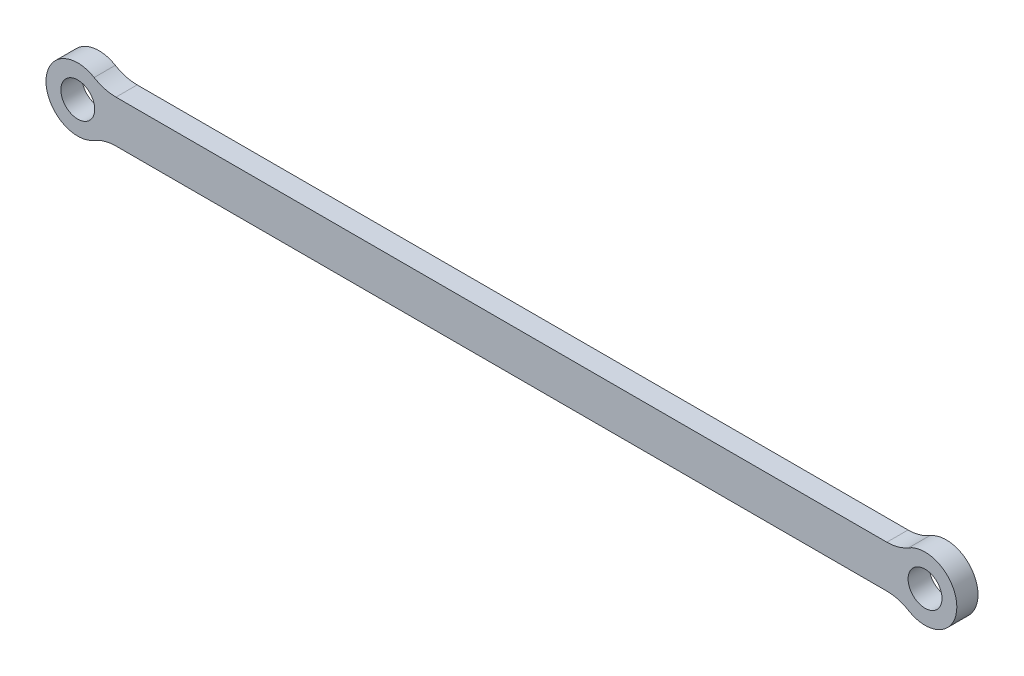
from build123d import *

# Parameters (mm, degrees)
CROQUIS1_R              = 4
SALIENTE_EXTRUIR1_DEPTH = 5


with BuildPart() as part:
    # Croquis1 → Saliente-Extruir1 (new body)
    with BuildSketch(Plane.XY):
        with BuildLine():
            Line((-83.143853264, 347.100052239), (98.828390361, 347.100052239))
            ThreePointArc((98.828390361, 347.100052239), (101.50100278, 347.463811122), (103.979177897, 348.528623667))
            ThreePointArc((103.979177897, 348.528623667), (115.342268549, 342.100052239), (103.979177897, 335.67148081))
            ThreePointArc((103.979177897, 335.67148081), (101.50100278, 336.736293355), (98.828390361, 337.100052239))
            Line((98.828390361, 337.100052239), (-83.143853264, 337.100052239))
            ThreePointArc((-83.143853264, 337.100052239), (-85.816465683, 336.736293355), (-88.2946408, 335.67148081))
            ThreePointArc((-88.2946408, 335.67148081), (-99.657731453, 342.100052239), (-88.2946408, 348.528623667))
            ThreePointArc((-88.2946408, 348.528623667), (-85.816465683, 347.463811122), (-83.143853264, 347.100052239))
        make_face()
        with Locations((-92.157731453, 342.100052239)):
            Circle(CROQUIS1_R, mode=Mode.SUBTRACT)
        with Locations((107.842268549, 342.100052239)):
            Circle(CROQUIS1_R, mode=Mode.SUBTRACT)
    extrude(amount=SALIENTE_EXTRUIR1_DEPTH)


solid = part.part
